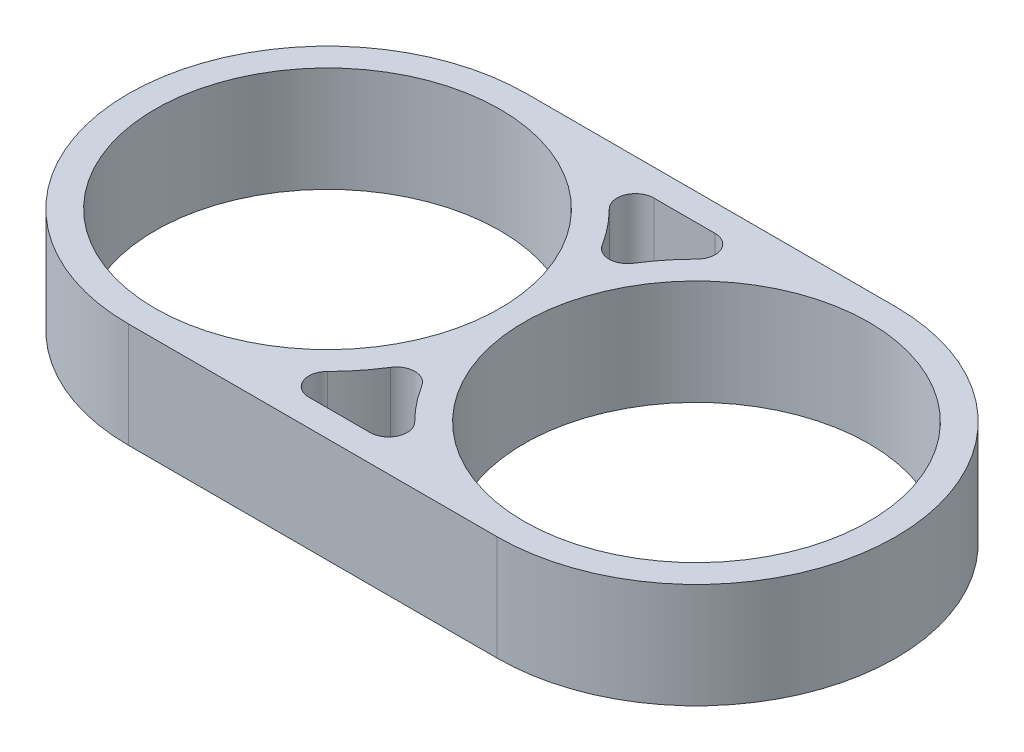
ISO-10303-21;
HEADER;
FILE_DESCRIPTION(('STEP AP214'),'2;1');
FILE_NAME('part.step','',(''),(''),'','','');
FILE_SCHEMA(('AUTOMOTIVE_DESIGN { 1 0 10303 214 1 1 1 1 }'));
ENDSEC;
DATA;
#1=APPLICATION_CONTEXT('core data for automotive mechanical design processes');
#2=APPLICATION_PROTOCOL_DEFINITION('international standard','automotive_design',2000,#1);
#3=PRODUCT_CONTEXT('',#1,'mechanical');
#4=PRODUCT('Part','Part','',(#3));
#5=PRODUCT_RELATED_PRODUCT_CATEGORY('part','',(#4));
#6=PRODUCT_DEFINITION_FORMATION('','',#4);
#7=PRODUCT_DEFINITION_CONTEXT('part definition',#1,'design');
#8=PRODUCT_DEFINITION('design','',#6,#7);
#9=PRODUCT_DEFINITION_SHAPE('','',#8);
#10=(LENGTH_UNIT() NAMED_UNIT(*) SI_UNIT(.MILLI.,.METRE.));
#11=(NAMED_UNIT(*) PLANE_ANGLE_UNIT() SI_UNIT($,.RADIAN.));
#12=(NAMED_UNIT(*) SI_UNIT($,.STERADIAN.) SOLID_ANGLE_UNIT());
#13=UNCERTAINTY_MEASURE_WITH_UNIT(LENGTH_MEASURE(1.E-05),#10,'distance_accuracy_value','');
#14=(GEOMETRIC_REPRESENTATION_CONTEXT(3) GLOBAL_UNCERTAINTY_ASSIGNED_CONTEXT((#13)) GLOBAL_UNIT_ASSIGNED_CONTEXT((#10,
#11,#12)) REPRESENTATION_CONTEXT('',''));
#15=CARTESIAN_POINT('',(0.,0.,0.));
#16=DIRECTION('',(0.,0.,1.));
#17=DIRECTION('',(1.,0.,0.));
#18=AXIS2_PLACEMENT_3D('',#15,#16,#17);
#19=CARTESIAN_POINT('',(-10.,5.7,0.));
#20=DIRECTION('',(0.,1.,0.));
#21=DIRECTION('',(0.,0.,1.));
#22=AXIS2_PLACEMENT_3D('',#19,#20,#21);
#23=PLANE('',#22);
#24=CARTESIAN_POINT('',(-10.,5.7,0.));
#25=DIRECTION('',(0.,1.,0.));
#26=DIRECTION('',(0.,0.,1.));
#27=AXIS2_PLACEMENT_3D('',#24,#25,#26);
#28=CIRCLE('',#27,9.35);
#29=CARTESIAN_POINT('',(-10.,5.7,9.35));
#30=VERTEX_POINT('',#29);
#31=EDGE_CURVE('E256',#30,#30,#28,.T.);
#32=ORIENTED_EDGE('',*,*,#31,.F.);
#33=EDGE_LOOP('',(#32));
#34=FACE_BOUND('',#33,.T.);
#35=CARTESIAN_POINT('',(-10.,5.7,0.));
#36=DIRECTION('',(0.,1.,0.));
#37=DIRECTION('',(0.,0.,1.));
#38=AXIS2_PLACEMENT_3D('',#35,#36,#37);
#39=CIRCLE('',#38,10.8);
#40=CARTESIAN_POINT('',(-10.,5.7,-10.8));
#41=VERTEX_POINT('',#40);
#42=CARTESIAN_POINT('',(-9.99999999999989,5.7,10.8));
#43=VERTEX_POINT('',#42);
#44=EDGE_CURVE('E262',#41,#43,#39,.T.);
#45=ORIENTED_EDGE('',*,*,#44,.T.);
#46=DIRECTION('',(1.,0.,0.));
#47=VECTOR('',#46,1.);
#48=CARTESIAN_POINT('',(10.0000000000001,5.7,10.8));
#49=LINE('',#48,#47);
#50=CARTESIAN_POINT('',(10.0000000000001,5.7,10.8));
#51=VERTEX_POINT('',#50);
#52=EDGE_CURVE('E265',#43,#51,#49,.T.);
#53=ORIENTED_EDGE('',*,*,#52,.T.);
#54=CARTESIAN_POINT('',(10.,5.7,0.));
#55=DIRECTION('',(0.,1.,0.));
#56=DIRECTION('',(0.,0.,1.));
#57=AXIS2_PLACEMENT_3D('',#54,#55,#56);
#58=CIRCLE('',#57,10.8);
#59=CARTESIAN_POINT('',(9.99999999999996,5.7,-10.8));
#60=VERTEX_POINT('',#59);
#61=EDGE_CURVE('E268',#51,#60,#58,.T.);
#62=ORIENTED_EDGE('',*,*,#61,.T.);
#63=DIRECTION('',(-1.,0.,0.));
#64=VECTOR('',#63,1.);
#65=CARTESIAN_POINT('',(-10.,5.7,-10.8));
#66=LINE('',#65,#64);
#67=EDGE_CURVE('E270',#60,#41,#66,.T.);
#68=ORIENTED_EDGE('',*,*,#67,.T.);
#69=EDGE_LOOP('',(#45,#53,#62,#68));
#70=FACE_BOUND('',#69,.T.);
#71=CARTESIAN_POINT('',(10.,5.7,0.));
#72=DIRECTION('',(0.,1.,0.));
#73=DIRECTION('',(0.,0.,1.));
#74=AXIS2_PLACEMENT_3D('',#71,#72,#73);
#75=CIRCLE('',#74,9.35);
#76=CARTESIAN_POINT('',(10.,5.7,9.35));
#77=VERTEX_POINT('',#76);
#78=EDGE_CURVE('E250',#77,#77,#75,.T.);
#79=ORIENTED_EDGE('',*,*,#78,.F.);
#80=EDGE_LOOP('',(#79));
#81=FACE_BOUND('',#80,.T.);
#82=DIRECTION('',(1.,0.,0.));
#83=VECTOR('',#82,1.);
#84=CARTESIAN_POINT('',(-1.66228448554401,5.7,9.35));
#85=LINE('',#84,#83);
#86=CARTESIAN_POINT('',(-1.66228448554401,5.7,9.35));
#87=VERTEX_POINT('',#86);
#88=CARTESIAN_POINT('',(1.66228448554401,5.7,9.35));
#89=VERTEX_POINT('',#88);
#90=EDGE_CURVE('E207',#87,#89,#85,.T.);
#91=ORIENTED_EDGE('',*,*,#90,.F.);
#92=CARTESIAN_POINT('',(-1.66228448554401,5.7,8.35));
#93=DIRECTION('',(0.,1.,0.));
#94=DIRECTION('',(0.,0.,-1.));
#95=AXIS2_PLACEMENT_3D('',#92,#93,#94);
#96=CIRCLE('',#95,1.);
#97=CARTESIAN_POINT('',(-2.36887054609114,5.7,7.64237288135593));
#98=VERTEX_POINT('',#97);
#99=EDGE_CURVE('E205',#98,#87,#96,.T.);
#100=ORIENTED_EDGE('',*,*,#99,.F.);
#101=CARTESIAN_POINT('',(-10.,5.7,0.));
#102=DIRECTION('',(0.,-1.,0.));
#103=DIRECTION('',(0.,0.,1.));
#104=AXIS2_PLACEMENT_3D('',#101,#102,#103);
#105=CIRCLE('',#104,10.8);
#106=CARTESIAN_POINT('',(-0.847457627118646,5.7,5.73332086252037));
#107=VERTEX_POINT('',#106);
#108=EDGE_CURVE('E217',#107,#98,#105,.T.);
#109=ORIENTED_EDGE('',*,*,#108,.F.);
#110=CARTESIAN_POINT('',(0.,5.7,6.26418390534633));
#111=DIRECTION('',(0.,1.,0.));
#112=DIRECTION('',(0.,0.,1.));
#113=AXIS2_PLACEMENT_3D('',#110,#111,#112);
#114=CIRCLE('',#113,1.);
#115=CARTESIAN_POINT('',(0.847457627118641,5.7,5.73332086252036));
#116=VERTEX_POINT('',#115);
#117=EDGE_CURVE('E214',#116,#107,#114,.T.);
#118=ORIENTED_EDGE('',*,*,#117,.F.);
#119=CARTESIAN_POINT('',(10.,5.7,0.));
#120=DIRECTION('',(0.,-1.,0.));
#121=DIRECTION('',(0.,0.,1.));
#122=AXIS2_PLACEMENT_3D('',#119,#120,#121);
#123=CIRCLE('',#122,10.8);
#124=CARTESIAN_POINT('',(2.36887054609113,5.7,7.64237288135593));
#125=VERTEX_POINT('',#124);
#126=EDGE_CURVE('E212',#125,#116,#123,.T.);
#127=ORIENTED_EDGE('',*,*,#126,.F.);
#128=CARTESIAN_POINT('',(1.66228448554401,5.7,8.35));
#129=DIRECTION('',(0.,1.,0.));
#130=DIRECTION('',(0.,0.,1.));
#131=AXIS2_PLACEMENT_3D('',#128,#129,#130);
#132=CIRCLE('',#131,1.);
#133=EDGE_CURVE('E210',#89,#125,#132,.T.);
#134=ORIENTED_EDGE('',*,*,#133,.F.);
#135=EDGE_LOOP('',(#91,#100,#109,#118,#127,#134));
#136=FACE_BOUND('',#135,.T.);
#137=CARTESIAN_POINT('',(10.,5.7,0.));
#138=DIRECTION('',(0.,-1.,0.));
#139=DIRECTION('',(0.,0.,1.));
#140=AXIS2_PLACEMENT_3D('',#137,#138,#139);
#141=CIRCLE('',#140,10.8);
#142=CARTESIAN_POINT('',(0.847457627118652,5.7,-5.73332086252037));
#143=VERTEX_POINT('',#142);
#144=CARTESIAN_POINT('',(2.36887054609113,5.7,-7.64237288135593));
#145=VERTEX_POINT('',#144);
#146=EDGE_CURVE('E162',#143,#145,#141,.T.);
#147=ORIENTED_EDGE('',*,*,#146,.F.);
#148=CARTESIAN_POINT('',(0.,5.7,-6.26418390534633));
#149=DIRECTION('',(0.,1.,0.));
#150=DIRECTION('',(0.,0.,1.));
#151=AXIS2_PLACEMENT_3D('',#148,#149,#150);
#152=CIRCLE('',#151,1.);
#153=CARTESIAN_POINT('',(-0.847457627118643,5.7,-5.73332086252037));
#154=VERTEX_POINT('',#153);
#155=EDGE_CURVE('E154',#154,#143,#152,.T.);
#156=ORIENTED_EDGE('',*,*,#155,.F.);
#157=CARTESIAN_POINT('',(-10.,5.7,0.));
#158=DIRECTION('',(0.,-1.,0.));
#159=DIRECTION('',(0.,0.,1.));
#160=AXIS2_PLACEMENT_3D('',#157,#158,#159);
#161=CIRCLE('',#160,10.8);
#162=CARTESIAN_POINT('',(-2.36887054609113,5.7,-7.64237288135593));
#163=VERTEX_POINT('',#162);
#164=EDGE_CURVE('E183',#163,#154,#161,.T.);
#165=ORIENTED_EDGE('',*,*,#164,.F.);
#166=CARTESIAN_POINT('',(-1.66228448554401,5.7,-8.35));
#167=DIRECTION('',(0.,1.,0.));
#168=DIRECTION('',(0.,0.,1.));
#169=AXIS2_PLACEMENT_3D('',#166,#167,#168);
#170=CIRCLE('',#169,1.);
#171=CARTESIAN_POINT('',(-1.66228448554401,5.7,-9.35));
#172=VERTEX_POINT('',#171);
#173=EDGE_CURVE('E181',#172,#163,#170,.T.);
#174=ORIENTED_EDGE('',*,*,#173,.F.);
#175=DIRECTION('',(-1.,0.,0.));
#176=VECTOR('',#175,1.);
#177=CARTESIAN_POINT('',(1.66228448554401,5.7,-9.35));
#178=LINE('',#177,#176);
#179=CARTESIAN_POINT('',(1.66228448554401,5.7,-9.35));
#180=VERTEX_POINT('',#179);
#181=EDGE_CURVE('E177',#180,#172,#178,.T.);
#182=ORIENTED_EDGE('',*,*,#181,.F.);
#183=CARTESIAN_POINT('',(1.66228448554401,5.7,-8.35));
#184=DIRECTION('',(0.,1.,0.));
#185=DIRECTION('',(0.,0.,1.));
#186=AXIS2_PLACEMENT_3D('',#183,#184,#185);
#187=CIRCLE('',#186,1.);
#188=EDGE_CURVE('E175',#145,#180,#187,.T.);
#189=ORIENTED_EDGE('',*,*,#188,.F.);
#190=EDGE_LOOP('',(#147,#156,#165,#174,#182,#189));
#191=FACE_BOUND('',#190,.T.);
#192=ADVANCED_FACE('F41',(#34,#70,#81,#136,#191),#23,.T.);
#193=CARTESIAN_POINT('',(-10.,0.,0.));
#194=DIRECTION('',(0.,1.,0.));
#195=DIRECTION('',(0.,0.,1.));
#196=AXIS2_PLACEMENT_3D('',#193,#194,#195);
#197=PLANE('',#196);
#198=CARTESIAN_POINT('',(-1.66228448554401,0.,8.35));
#199=DIRECTION('',(0.,1.,0.));
#200=DIRECTION('',(0.,0.,-1.));
#201=AXIS2_PLACEMENT_3D('',#198,#199,#200);
#202=CIRCLE('',#201,1.);
#203=CARTESIAN_POINT('',(-2.36887054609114,0.,7.64237288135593));
#204=VERTEX_POINT('',#203);
#205=CARTESIAN_POINT('',(-1.66228448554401,0.,9.35));
#206=VERTEX_POINT('',#205);
#207=EDGE_CURVE('E170',#204,#206,#202,.T.);
#208=ORIENTED_EDGE('',*,*,#207,.T.);
#209=DIRECTION('',(1.,0.,0.));
#210=VECTOR('',#209,1.);
#211=CARTESIAN_POINT('',(-1.66228448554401,0.,9.35));
#212=LINE('',#211,#210);
#213=CARTESIAN_POINT('',(1.66228448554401,0.,9.35));
#214=VERTEX_POINT('',#213);
#215=EDGE_CURVE('E222',#206,#214,#212,.T.);
#216=ORIENTED_EDGE('',*,*,#215,.T.);
#217=CARTESIAN_POINT('',(1.66228448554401,0.,8.35));
#218=DIRECTION('',(0.,1.,0.));
#219=DIRECTION('',(0.,0.,1.));
#220=AXIS2_PLACEMENT_3D('',#217,#218,#219);
#221=CIRCLE('',#220,1.);
#222=CARTESIAN_POINT('',(2.36887054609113,0.,7.64237288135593));
#223=VERTEX_POINT('',#222);
#224=EDGE_CURVE('E225',#214,#223,#221,.T.);
#225=ORIENTED_EDGE('',*,*,#224,.T.);
#226=CARTESIAN_POINT('',(10.,0.,0.));
#227=DIRECTION('',(0.,-1.,0.));
#228=DIRECTION('',(0.,0.,1.));
#229=AXIS2_PLACEMENT_3D('',#226,#227,#228);
#230=CIRCLE('',#229,10.8);
#231=CARTESIAN_POINT('',(0.847457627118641,0.,5.73332086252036));
#232=VERTEX_POINT('',#231);
#233=EDGE_CURVE('E228',#223,#232,#230,.T.);
#234=ORIENTED_EDGE('',*,*,#233,.T.);
#235=CARTESIAN_POINT('',(0.,0.,6.26418390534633));
#236=DIRECTION('',(0.,1.,0.));
#237=DIRECTION('',(0.,0.,1.));
#238=AXIS2_PLACEMENT_3D('',#235,#236,#237);
#239=CIRCLE('',#238,1.);
#240=CARTESIAN_POINT('',(-0.847457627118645,0.,5.73332086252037));
#241=VERTEX_POINT('',#240);
#242=EDGE_CURVE('E231',#232,#241,#239,.T.);
#243=ORIENTED_EDGE('',*,*,#242,.T.);
#244=CARTESIAN_POINT('',(-10.,0.,0.));
#245=DIRECTION('',(0.,-1.,0.));
#246=DIRECTION('',(0.,0.,1.));
#247=AXIS2_PLACEMENT_3D('',#244,#245,#246);
#248=CIRCLE('',#247,10.8);
#249=EDGE_CURVE('E208',#241,#204,#248,.T.);
#250=ORIENTED_EDGE('',*,*,#249,.T.);
#251=EDGE_LOOP('',(#208,#216,#225,#234,#243,#250));
#252=FACE_BOUND('',#251,.T.);
#253=CARTESIAN_POINT('',(-10.,0.,0.));
#254=DIRECTION('',(0.,1.,0.));
#255=DIRECTION('',(0.,0.,1.));
#256=AXIS2_PLACEMENT_3D('',#253,#254,#255);
#257=CIRCLE('',#256,10.8);
#258=CARTESIAN_POINT('',(-10.,0.,-10.8));
#259=VERTEX_POINT('',#258);
#260=CARTESIAN_POINT('',(-9.99999999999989,0.,10.8));
#261=VERTEX_POINT('',#260);
#262=EDGE_CURVE('E259',#259,#261,#257,.T.);
#263=ORIENTED_EDGE('',*,*,#262,.F.);
#264=DIRECTION('',(-1.,0.,0.));
#265=VECTOR('',#264,1.);
#266=CARTESIAN_POINT('',(-10.,0.,-10.8));
#267=LINE('',#266,#265);
#268=CARTESIAN_POINT('',(9.99999999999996,0.,-10.8));
#269=VERTEX_POINT('',#268);
#270=EDGE_CURVE('E266',#269,#259,#267,.T.);
#271=ORIENTED_EDGE('',*,*,#270,.F.);
#272=CARTESIAN_POINT('',(10.,0.,0.));
#273=DIRECTION('',(0.,1.,0.));
#274=DIRECTION('',(0.,0.,1.));
#275=AXIS2_PLACEMENT_3D('',#272,#273,#274);
#276=CIRCLE('',#275,10.8);
#277=CARTESIAN_POINT('',(10.0000000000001,0.,10.8));
#278=VERTEX_POINT('',#277);
#279=EDGE_CURVE('E277',#278,#269,#276,.T.);
#280=ORIENTED_EDGE('',*,*,#279,.F.);
#281=DIRECTION('',(1.,0.,0.));
#282=VECTOR('',#281,1.);
#283=CARTESIAN_POINT('',(10.0000000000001,0.,10.8));
#284=LINE('',#283,#282);
#285=EDGE_CURVE('E275',#261,#278,#284,.T.);
#286=ORIENTED_EDGE('',*,*,#285,.F.);
#287=EDGE_LOOP('',(#263,#271,#280,#286));
#288=FACE_BOUND('',#287,.T.);
#289=CARTESIAN_POINT('',(-10.,0.,0.));
#290=DIRECTION('',(0.,1.,0.));
#291=DIRECTION('',(0.,0.,1.));
#292=AXIS2_PLACEMENT_3D('',#289,#290,#291);
#293=CIRCLE('',#292,9.35);
#294=CARTESIAN_POINT('',(-10.,0.,9.35));
#295=VERTEX_POINT('',#294);
#296=EDGE_CURVE('E253',#295,#295,#293,.T.);
#297=ORIENTED_EDGE('',*,*,#296,.T.);
#298=EDGE_LOOP('',(#297));
#299=FACE_BOUND('',#298,.T.);
#300=CARTESIAN_POINT('',(10.,0.,0.));
#301=DIRECTION('',(0.,1.,0.));
#302=DIRECTION('',(0.,0.,1.));
#303=AXIS2_PLACEMENT_3D('',#300,#301,#302);
#304=CIRCLE('',#303,9.35);
#305=CARTESIAN_POINT('',(10.,0.,9.35));
#306=VERTEX_POINT('',#305);
#307=EDGE_CURVE('E249',#306,#306,#304,.T.);
#308=ORIENTED_EDGE('',*,*,#307,.T.);
#309=EDGE_LOOP('',(#308));
#310=FACE_BOUND('',#309,.T.);
#311=CARTESIAN_POINT('',(0.,0.,-6.26418390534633));
#312=DIRECTION('',(0.,1.,0.));
#313=DIRECTION('',(0.,0.,1.));
#314=AXIS2_PLACEMENT_3D('',#311,#312,#313);
#315=CIRCLE('',#314,1.);
#316=CARTESIAN_POINT('',(-0.847457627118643,0.,-5.73332086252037));
#317=VERTEX_POINT('',#316);
#318=CARTESIAN_POINT('',(0.847457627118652,0.,-5.73332086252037));
#319=VERTEX_POINT('',#318);
#320=EDGE_CURVE('E64',#317,#319,#315,.T.);
#321=ORIENTED_EDGE('',*,*,#320,.T.);
#322=CARTESIAN_POINT('',(10.,0.,0.));
#323=DIRECTION('',(0.,-1.,0.));
#324=DIRECTION('',(0.,0.,1.));
#325=AXIS2_PLACEMENT_3D('',#322,#323,#324);
#326=CIRCLE('',#325,10.8);
#327=CARTESIAN_POINT('',(2.36887054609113,0.,-7.64237288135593));
#328=VERTEX_POINT('',#327);
#329=EDGE_CURVE('E169',#319,#328,#326,.T.);
#330=ORIENTED_EDGE('',*,*,#329,.T.);
#331=CARTESIAN_POINT('',(1.66228448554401,0.,-8.35));
#332=DIRECTION('',(0.,1.,0.));
#333=DIRECTION('',(0.,0.,1.));
#334=AXIS2_PLACEMENT_3D('',#331,#332,#333);
#335=CIRCLE('',#334,1.);
#336=CARTESIAN_POINT('',(1.66228448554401,0.,-9.35));
#337=VERTEX_POINT('',#336);
#338=EDGE_CURVE('E187',#328,#337,#335,.T.);
#339=ORIENTED_EDGE('',*,*,#338,.T.);
#340=DIRECTION('',(-1.,0.,0.));
#341=VECTOR('',#340,1.);
#342=CARTESIAN_POINT('',(1.66228448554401,0.,-9.35));
#343=LINE('',#342,#341);
#344=CARTESIAN_POINT('',(-1.66228448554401,0.,-9.35));
#345=VERTEX_POINT('',#344);
#346=EDGE_CURVE('E190',#337,#345,#343,.T.);
#347=ORIENTED_EDGE('',*,*,#346,.T.);
#348=CARTESIAN_POINT('',(-1.66228448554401,0.,-8.35));
#349=DIRECTION('',(0.,1.,0.));
#350=DIRECTION('',(0.,0.,1.));
#351=AXIS2_PLACEMENT_3D('',#348,#349,#350);
#352=CIRCLE('',#351,1.);
#353=CARTESIAN_POINT('',(-2.36887054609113,0.,-7.64237288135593));
#354=VERTEX_POINT('',#353);
#355=EDGE_CURVE('E193',#345,#354,#352,.T.);
#356=ORIENTED_EDGE('',*,*,#355,.T.);
#357=CARTESIAN_POINT('',(-10.,0.,0.));
#358=DIRECTION('',(0.,-1.,0.));
#359=DIRECTION('',(0.,0.,1.));
#360=AXIS2_PLACEMENT_3D('',#357,#358,#359);
#361=CIRCLE('',#360,10.8);
#362=EDGE_CURVE('E163',#354,#317,#361,.T.);
#363=ORIENTED_EDGE('',*,*,#362,.T.);
#364=EDGE_LOOP('',(#321,#330,#339,#347,#356,#363));
#365=FACE_BOUND('',#364,.T.);
#366=ADVANCED_FACE('F295',(#252,#288,#299,#310,#365),#197,.F.);
#367=CARTESIAN_POINT('',(-10.,5.7,0.));
#368=DIRECTION('',(0.,-1.,0.));
#369=DIRECTION('',(0.,0.,-1.));
#370=AXIS2_PLACEMENT_3D('',#367,#368,#369);
#371=CYLINDRICAL_SURFACE('',#370,10.8);
#372=ORIENTED_EDGE('',*,*,#262,.T.);
#373=DIRECTION('',(0.,-1.,0.));
#374=VECTOR('',#373,1.);
#375=CARTESIAN_POINT('',(-9.99999999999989,5.7,10.8));
#376=LINE('',#375,#374);
#377=EDGE_CURVE('E11',#43,#261,#376,.T.);
#378=ORIENTED_EDGE('',*,*,#377,.F.);
#379=ORIENTED_EDGE('',*,*,#44,.F.);
#380=DIRECTION('',(0.,-1.,0.));
#381=VECTOR('',#380,1.);
#382=CARTESIAN_POINT('',(-10.,5.7,-10.8));
#383=LINE('',#382,#381);
#384=EDGE_CURVE('E272',#41,#259,#383,.T.);
#385=ORIENTED_EDGE('',*,*,#384,.T.);
#386=EDGE_LOOP('',(#372,#378,#379,#385));
#387=FACE_BOUND('',#386,.T.);
#388=ADVANCED_FACE('F43',(#387),#371,.T.);
#389=CARTESIAN_POINT('',(10.0000000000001,5.7,10.8));
#390=DIRECTION('',(0.,0.,-1.));
#391=DIRECTION('',(-1.,0.,0.));
#392=AXIS2_PLACEMENT_3D('',#389,#390,#391);
#393=PLANE('',#392);
#394=ORIENTED_EDGE('',*,*,#285,.T.);
#395=DIRECTION('',(0.,-1.,0.));
#396=VECTOR('',#395,1.);
#397=CARTESIAN_POINT('',(10.0000000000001,5.7,10.8));
#398=LINE('',#397,#396);
#399=EDGE_CURVE('E49',#51,#278,#398,.T.);
#400=ORIENTED_EDGE('',*,*,#399,.F.);
#401=ORIENTED_EDGE('',*,*,#52,.F.);
#402=ORIENTED_EDGE('',*,*,#377,.T.);
#403=EDGE_LOOP('',(#394,#400,#401,#402));
#404=FACE_BOUND('',#403,.T.);
#405=ADVANCED_FACE('F306',(#404),#393,.F.);
#406=CARTESIAN_POINT('',(10.,5.7,0.));
#407=DIRECTION('',(0.,-1.,0.));
#408=DIRECTION('',(0.,0.,-1.));
#409=AXIS2_PLACEMENT_3D('',#406,#407,#408);
#410=CYLINDRICAL_SURFACE('',#409,10.8);
#411=ORIENTED_EDGE('',*,*,#279,.T.);
#412=DIRECTION('',(0.,-1.,0.));
#413=VECTOR('',#412,1.);
#414=CARTESIAN_POINT('',(9.99999999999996,5.7,-10.8));
#415=LINE('',#414,#413);
#416=EDGE_CURVE('E282',#60,#269,#415,.T.);
#417=ORIENTED_EDGE('',*,*,#416,.F.);
#418=ORIENTED_EDGE('',*,*,#61,.F.);
#419=ORIENTED_EDGE('',*,*,#399,.T.);
#420=EDGE_LOOP('',(#411,#417,#418,#419));
#421=FACE_BOUND('',#420,.T.);
#422=ADVANCED_FACE('F289',(#421),#410,.T.);
#423=CARTESIAN_POINT('',(-10.,5.7,-10.8));
#424=DIRECTION('',(0.,0.,1.));
#425=DIRECTION('',(1.,0.,0.));
#426=AXIS2_PLACEMENT_3D('',#423,#424,#425);
#427=PLANE('',#426);
#428=ORIENTED_EDGE('',*,*,#270,.T.);
#429=ORIENTED_EDGE('',*,*,#384,.F.);
#430=ORIENTED_EDGE('',*,*,#67,.F.);
#431=ORIENTED_EDGE('',*,*,#416,.T.);
#432=EDGE_LOOP('',(#428,#429,#430,#431));
#433=FACE_BOUND('',#432,.T.);
#434=ADVANCED_FACE('F299',(#433),#427,.F.);
#435=CARTESIAN_POINT('',(-10.,5.7,0.));
#436=DIRECTION('',(0.,-1.,0.));
#437=DIRECTION('',(0.,0.,-1.));
#438=AXIS2_PLACEMENT_3D('',#435,#436,#437);
#439=CYLINDRICAL_SURFACE('',#438,9.35);
#440=ORIENTED_EDGE('',*,*,#31,.T.);
#441=EDGE_LOOP('',(#440));
#442=FACE_BOUND('',#441,.T.);
#443=ORIENTED_EDGE('',*,*,#296,.F.);
#444=EDGE_LOOP('',(#443));
#445=FACE_BOUND('',#444,.T.);
#446=ADVANCED_FACE('F323',(#442,#445),#439,.F.);
#447=CARTESIAN_POINT('',(10.,5.7,0.));
#448=DIRECTION('',(0.,-1.,0.));
#449=DIRECTION('',(0.,0.,-1.));
#450=AXIS2_PLACEMENT_3D('',#447,#448,#449);
#451=CYLINDRICAL_SURFACE('',#450,9.35);
#452=ORIENTED_EDGE('',*,*,#78,.T.);
#453=EDGE_LOOP('',(#452));
#454=FACE_BOUND('',#453,.T.);
#455=ORIENTED_EDGE('',*,*,#307,.F.);
#456=EDGE_LOOP('',(#455));
#457=FACE_BOUND('',#456,.T.);
#458=ADVANCED_FACE('F330',(#454,#457),#451,.F.);
#459=CARTESIAN_POINT('',(-1.66228448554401,5.7,8.35));
#460=DIRECTION('',(0.,-1.,0.));
#461=DIRECTION('',(0.,0.,-1.));
#462=AXIS2_PLACEMENT_3D('',#459,#460,#461);
#463=CYLINDRICAL_SURFACE('',#462,1.);
#464=ORIENTED_EDGE('',*,*,#207,.F.);
#465=DIRECTION('',(0.,-1.,0.));
#466=VECTOR('',#465,1.);
#467=CARTESIAN_POINT('',(-2.36887054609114,5.7,7.64237288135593));
#468=LINE('',#467,#466);
#469=EDGE_CURVE('E219',#98,#204,#468,.T.);
#470=ORIENTED_EDGE('',*,*,#469,.F.);
#471=ORIENTED_EDGE('',*,*,#99,.T.);
#472=DIRECTION('',(0.,-1.,0.));
#473=VECTOR('',#472,1.);
#474=CARTESIAN_POINT('',(-1.66228448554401,5.7,9.35));
#475=LINE('',#474,#473);
#476=EDGE_CURVE('E246',#87,#206,#475,.T.);
#477=ORIENTED_EDGE('',*,*,#476,.T.);
#478=EDGE_LOOP('',(#464,#470,#471,#477));
#479=FACE_BOUND('',#478,.T.);
#480=ADVANCED_FACE('F335',(#479),#463,.F.);
#481=CARTESIAN_POINT('',(-1.66228448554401,5.7,9.35));
#482=DIRECTION('',(0.,0.,-1.));
#483=DIRECTION('',(-1.,0.,0.));
#484=AXIS2_PLACEMENT_3D('',#481,#482,#483);
#485=PLANE('',#484);
#486=ORIENTED_EDGE('',*,*,#215,.F.);
#487=ORIENTED_EDGE('',*,*,#476,.F.);
#488=ORIENTED_EDGE('',*,*,#90,.T.);
#489=DIRECTION('',(0.,-1.,0.));
#490=VECTOR('',#489,1.);
#491=CARTESIAN_POINT('',(1.66228448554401,5.7,9.35));
#492=LINE('',#491,#490);
#493=EDGE_CURVE('E244',#89,#214,#492,.T.);
#494=ORIENTED_EDGE('',*,*,#493,.T.);
#495=EDGE_LOOP('',(#486,#487,#488,#494));
#496=FACE_BOUND('',#495,.T.);
#497=ADVANCED_FACE('F382',(#496),#485,.T.);
#498=CARTESIAN_POINT('',(1.66228448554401,5.7,8.35));
#499=DIRECTION('',(0.,-1.,0.));
#500=DIRECTION('',(0.,0.,-1.));
#501=AXIS2_PLACEMENT_3D('',#498,#499,#500);
#502=CYLINDRICAL_SURFACE('',#501,1.);
#503=ORIENTED_EDGE('',*,*,#224,.F.);
#504=ORIENTED_EDGE('',*,*,#493,.F.);
#505=ORIENTED_EDGE('',*,*,#133,.T.);
#506=DIRECTION('',(0.,-1.,0.));
#507=VECTOR('',#506,1.);
#508=CARTESIAN_POINT('',(2.36887054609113,5.7,7.64237288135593));
#509=LINE('',#508,#507);
#510=EDGE_CURVE('E242',#125,#223,#509,.T.);
#511=ORIENTED_EDGE('',*,*,#510,.T.);
#512=EDGE_LOOP('',(#503,#504,#505,#511));
#513=FACE_BOUND('',#512,.T.);
#514=ADVANCED_FACE('F378',(#513),#502,.F.);
#515=CARTESIAN_POINT('',(10.,5.7,0.));
#516=DIRECTION('',(0.,-1.,0.));
#517=DIRECTION('',(0.,0.,-1.));
#518=AXIS2_PLACEMENT_3D('',#515,#516,#517);
#519=CYLINDRICAL_SURFACE('',#518,10.8);
#520=ORIENTED_EDGE('',*,*,#233,.F.);
#521=ORIENTED_EDGE('',*,*,#510,.F.);
#522=ORIENTED_EDGE('',*,*,#126,.T.);
#523=DIRECTION('',(0.,-1.,0.));
#524=VECTOR('',#523,1.);
#525=CARTESIAN_POINT('',(0.847457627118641,5.7,5.73332086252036));
#526=LINE('',#525,#524);
#527=EDGE_CURVE('E240',#116,#232,#526,.T.);
#528=ORIENTED_EDGE('',*,*,#527,.T.);
#529=EDGE_LOOP('',(#520,#521,#522,#528));
#530=FACE_BOUND('',#529,.T.);
#531=ADVANCED_FACE('F374',(#530),#519,.T.);
#532=CARTESIAN_POINT('',(0.,5.7,6.26418390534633));
#533=DIRECTION('',(0.,-1.,0.));
#534=DIRECTION('',(0.,0.,-1.));
#535=AXIS2_PLACEMENT_3D('',#532,#533,#534);
#536=CYLINDRICAL_SURFACE('',#535,1.);
#537=ORIENTED_EDGE('',*,*,#242,.F.);
#538=ORIENTED_EDGE('',*,*,#527,.F.);
#539=ORIENTED_EDGE('',*,*,#117,.T.);
#540=DIRECTION('',(0.,-1.,0.));
#541=VECTOR('',#540,1.);
#542=CARTESIAN_POINT('',(-0.847457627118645,5.7,5.73332086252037));
#543=LINE('',#542,#541);
#544=EDGE_CURVE('E238',#107,#241,#543,.T.);
#545=ORIENTED_EDGE('',*,*,#544,.T.);
#546=EDGE_LOOP('',(#537,#538,#539,#545));
#547=FACE_BOUND('',#546,.T.);
#548=ADVANCED_FACE('F370',(#547),#536,.F.);
#549=CARTESIAN_POINT('',(-10.,5.7,0.));
#550=DIRECTION('',(0.,-1.,0.));
#551=DIRECTION('',(0.,0.,-1.));
#552=AXIS2_PLACEMENT_3D('',#549,#550,#551);
#553=CYLINDRICAL_SURFACE('',#552,10.8);
#554=ORIENTED_EDGE('',*,*,#249,.F.);
#555=ORIENTED_EDGE('',*,*,#544,.F.);
#556=ORIENTED_EDGE('',*,*,#108,.T.);
#557=ORIENTED_EDGE('',*,*,#469,.T.);
#558=EDGE_LOOP('',(#554,#555,#556,#557));
#559=FACE_BOUND('',#558,.T.);
#560=ADVANCED_FACE('F367',(#559),#553,.T.);
#561=CARTESIAN_POINT('',(0.,5.7,-6.26418390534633));
#562=DIRECTION('',(0.,-1.,0.));
#563=DIRECTION('',(0.,0.,-1.));
#564=AXIS2_PLACEMENT_3D('',#561,#562,#563);
#565=CYLINDRICAL_SURFACE('',#564,1.);
#566=ORIENTED_EDGE('',*,*,#320,.F.);
#567=DIRECTION('',(0.,-1.,0.));
#568=VECTOR('',#567,1.);
#569=CARTESIAN_POINT('',(-0.847457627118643,5.7,-5.73332086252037));
#570=LINE('',#569,#568);
#571=EDGE_CURVE('E158',#154,#317,#570,.T.);
#572=ORIENTED_EDGE('',*,*,#571,.F.);
#573=ORIENTED_EDGE('',*,*,#155,.T.);
#574=DIRECTION('',(0.,-1.,0.));
#575=VECTOR('',#574,1.);
#576=CARTESIAN_POINT('',(0.847457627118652,5.7,-5.73332086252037));
#577=LINE('',#576,#575);
#578=EDGE_CURVE('E157',#143,#319,#577,.T.);
#579=ORIENTED_EDGE('',*,*,#578,.T.);
#580=EDGE_LOOP('',(#566,#572,#573,#579));
#581=FACE_BOUND('',#580,.T.);
#582=ADVANCED_FACE('F156',(#581),#565,.F.);
#583=CARTESIAN_POINT('',(10.,5.7,0.));
#584=DIRECTION('',(0.,-1.,0.));
#585=DIRECTION('',(0.,0.,-1.));
#586=AXIS2_PLACEMENT_3D('',#583,#584,#585);
#587=CYLINDRICAL_SURFACE('',#586,10.8);
#588=ORIENTED_EDGE('',*,*,#329,.F.);
#589=ORIENTED_EDGE('',*,*,#578,.F.);
#590=ORIENTED_EDGE('',*,*,#146,.T.);
#591=DIRECTION('',(0.,-1.,0.));
#592=VECTOR('',#591,1.);
#593=CARTESIAN_POINT('',(2.36887054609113,5.7,-7.64237288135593));
#594=LINE('',#593,#592);
#595=EDGE_CURVE('E171',#145,#328,#594,.T.);
#596=ORIENTED_EDGE('',*,*,#595,.T.);
#597=EDGE_LOOP('',(#588,#589,#590,#596));
#598=FACE_BOUND('',#597,.T.);
#599=ADVANCED_FACE('F166',(#598),#587,.T.);
#600=CARTESIAN_POINT('',(1.66228448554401,5.7,-8.35));
#601=DIRECTION('',(0.,-1.,0.));
#602=DIRECTION('',(0.,0.,-1.));
#603=AXIS2_PLACEMENT_3D('',#600,#601,#602);
#604=CYLINDRICAL_SURFACE('',#603,1.);
#605=ORIENTED_EDGE('',*,*,#338,.F.);
#606=ORIENTED_EDGE('',*,*,#595,.F.);
#607=ORIENTED_EDGE('',*,*,#188,.T.);
#608=DIRECTION('',(0.,-1.,0.));
#609=VECTOR('',#608,1.);
#610=CARTESIAN_POINT('',(1.66228448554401,5.7,-9.35));
#611=LINE('',#610,#609);
#612=EDGE_CURVE('E202',#180,#337,#611,.T.);
#613=ORIENTED_EDGE('',*,*,#612,.T.);
#614=EDGE_LOOP('',(#605,#606,#607,#613));
#615=FACE_BOUND('',#614,.T.);
#616=ADVANCED_FACE('F354',(#615),#604,.F.);
#617=CARTESIAN_POINT('',(1.66228448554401,5.7,-9.35));
#618=DIRECTION('',(0.,0.,1.));
#619=DIRECTION('',(1.,0.,0.));
#620=AXIS2_PLACEMENT_3D('',#617,#618,#619);
#621=PLANE('',#620);
#622=ORIENTED_EDGE('',*,*,#346,.F.);
#623=ORIENTED_EDGE('',*,*,#612,.F.);
#624=ORIENTED_EDGE('',*,*,#181,.T.);
#625=DIRECTION('',(0.,-1.,0.));
#626=VECTOR('',#625,1.);
#627=CARTESIAN_POINT('',(-1.66228448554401,5.7,-9.35));
#628=LINE('',#627,#626);
#629=EDGE_CURVE('E200',#172,#345,#628,.T.);
#630=ORIENTED_EDGE('',*,*,#629,.T.);
#631=EDGE_LOOP('',(#622,#623,#624,#630));
#632=FACE_BOUND('',#631,.T.);
#633=ADVANCED_FACE('F350',(#632),#621,.T.);
#634=CARTESIAN_POINT('',(-1.66228448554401,5.7,-8.35));
#635=DIRECTION('',(0.,-1.,0.));
#636=DIRECTION('',(0.,0.,-1.));
#637=AXIS2_PLACEMENT_3D('',#634,#635,#636);
#638=CYLINDRICAL_SURFACE('',#637,1.);
#639=ORIENTED_EDGE('',*,*,#355,.F.);
#640=ORIENTED_EDGE('',*,*,#629,.F.);
#641=ORIENTED_EDGE('',*,*,#173,.T.);
#642=DIRECTION('',(0.,-1.,0.));
#643=VECTOR('',#642,1.);
#644=CARTESIAN_POINT('',(-2.36887054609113,5.7,-7.64237288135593));
#645=LINE('',#644,#643);
#646=EDGE_CURVE('E56',#163,#354,#645,.T.);
#647=ORIENTED_EDGE('',*,*,#646,.T.);
#648=EDGE_LOOP('',(#639,#640,#641,#647));
#649=FACE_BOUND('',#648,.T.);
#650=ADVANCED_FACE('F347',(#649),#638,.F.);
#651=CARTESIAN_POINT('',(-10.,5.7,0.));
#652=DIRECTION('',(0.,-1.,0.));
#653=DIRECTION('',(0.,0.,-1.));
#654=AXIS2_PLACEMENT_3D('',#651,#652,#653);
#655=CYLINDRICAL_SURFACE('',#654,10.8);
#656=ORIENTED_EDGE('',*,*,#362,.F.);
#657=ORIENTED_EDGE('',*,*,#646,.F.);
#658=ORIENTED_EDGE('',*,*,#164,.T.);
#659=ORIENTED_EDGE('',*,*,#571,.T.);
#660=EDGE_LOOP('',(#656,#657,#658,#659));
#661=FACE_BOUND('',#660,.T.);
#662=ADVANCED_FACE('F343',(#661),#655,.T.);
#663=CLOSED_SHELL('',(#192,#366,#388,#405,#422,#434,#446,#458,#480,#497,#514,#531,#548,#560,
#582,#599,#616,#633,#650,#662));
#664=MANIFOLD_SOLID_BREP('B2',#663);
#665=ADVANCED_BREP_SHAPE_REPRESENTATION('',(#18,#664),#14);
#666=SHAPE_DEFINITION_REPRESENTATION(#9,#665);
ENDSEC;
END-ISO-10303-21;
